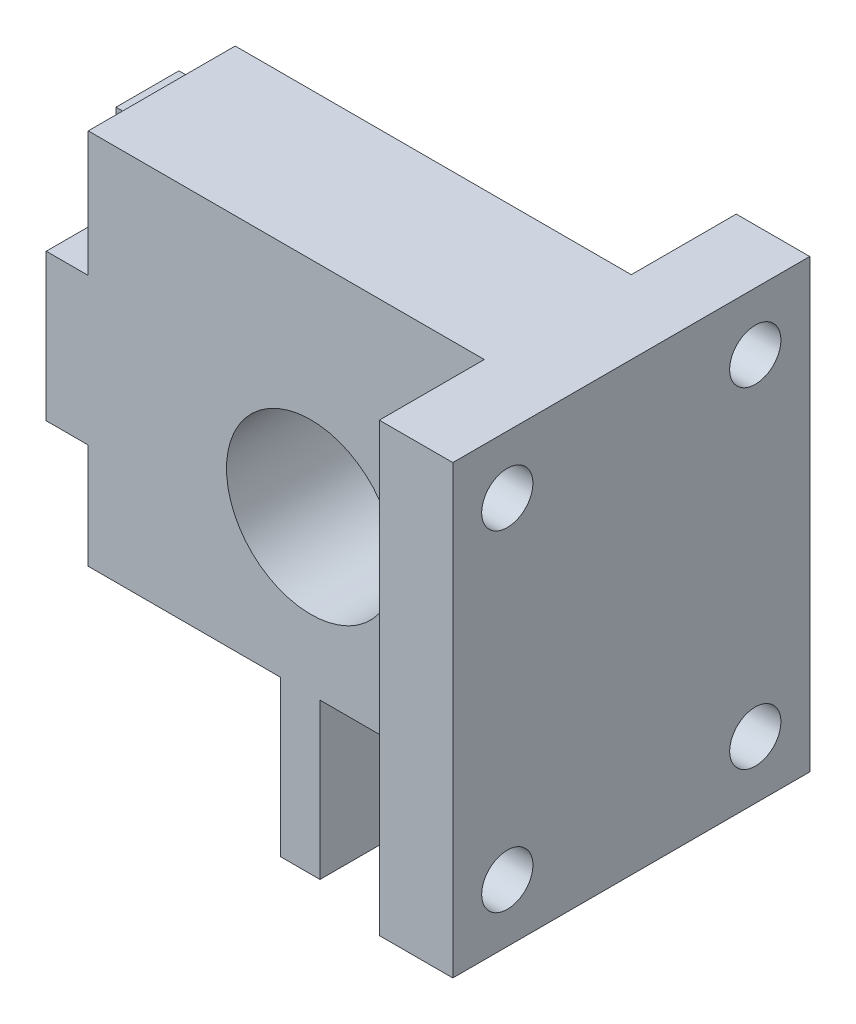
from build123d import *

# Parameters (mm, degrees)
SKETCH1_W                           = 49.611
SKETCH1_H                           = 27.0002
EXTRUDE1_DEPTH                      = 8.89
M12X1_0_TAPPED_HOLE1_D              = 10.2
SKETCH12_R                          = 7.9375
EXTRUDE2_DEPTH                      = 3.81
F_3_8_0_375000_DIAMETER_HOLE1_D     = 9.525
F_3_8_0_375000_DIAMETER_HOLE1_DEPTH = 25.4
F_3_8_0_375000_DIAMETER_HOLE1_TIP   = 2.861598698
SKETCH16_W                          = 4.445
SKETCH16_H                          = 27.0002
EXTRUDE4_DEPTH                      = 6.35
SKETCH19_W                          = 4.445
SKETCH19_H                          = 27.0002
EXTRUDE5_DEPTH                      = 6.35
M3_1_3_100000_DIAMETER_HOLE2_D      = 3.1
SKETCH20_W                          = 41.656
SKETCH20_H                          = 6.03470191
CUT_EXTRUDE1_DEPTH                  = 46.186567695
SKETCH21_W                          = 2.38125
SKETCH21_H                          = 8.89
EXTRUDE6_DEPTH                      = 9.398
CHAMFER2_SIZE                       = 8.89
SKETCH22_W                          = 21.209
SKETCH22_H                          = 22.8092
CUT_EXTRUDE2_DEPTH                  = 48.005625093
SKETCH23_W                          = 8.89
SKETCH23_H                          = 8.88492
EXTRUDE8_DEPTH                      = 2.54
SKETCH26_W                          = 11.7856
SKETCH26_H                          = 8.88492
EXTRUDE9_DEPTH                      = 4.572
SKETCH27_W                          = 5.4356
SKETCH27_H                          = 8.88492
CUT_EXTRUDE4_DEPTH                  = 0.762
M3_5X0_6_TAPPED_HOLE1_D             = 2.9
F_5_40_TAPPED_HOLE1_D               = 2.5781
F_5_40_TAPPED_HOLE1_DEPTH           = 6.985


with BuildPart() as part:
    # Sketch1 → Extrude1 (new body)
    with BuildSketch(Plane.XY):
        with Locations((15.5345, 0)):
            Rectangle(SKETCH1_W, SKETCH1_H)
    extrude(amount=EXTRUDE1_DEPTH)

    # M12x1.0 Tapped Hole1 (through all)
    with Locations(Plane.XY.offset(8.89)):
        with Locations((25.4, 0)):
            Hole(M12X1_0_TAPPED_HOLE1_D / 2)

    # Sketch12 → Extrude2 (add)
    with BuildSketch(Plane(origin=(0, 0, 0), x_dir=(-1, 0, 0), z_dir=(0, 0, -1))):
        with Locations(Location((0, 0, 0), (0, 0, 180))):
            Circle(SKETCH12_R)
    extrude(amount=EXTRUDE2_DEPTH)

    # 3_8 _0.375000_ Diameter Hole1
    with Locations(Plane.XY.offset(8.89)):
        with Locations((0, 0)):
            Hole(F_3_8_0_375000_DIAMETER_HOLE1_D / 2, depth=F_3_8_0_375000_DIAMETER_HOLE1_DEPTH)
            with Locations((0, 0, -(F_3_8_0_375000_DIAMETER_HOLE1_DEPTH + F_3_8_0_375000_DIAMETER_HOLE1_TIP / 2))):  # 118° drill point
                Cone(0, F_3_8_0_375000_DIAMETER_HOLE1_D / 2, F_3_8_0_375000_DIAMETER_HOLE1_TIP, mode=Mode.SUBTRACT)

    # Sketch16 → Extrude4 (add)
    with BuildSketch(Plane(origin=(0, 0, 0), x_dir=(-1, 0, 0), z_dir=(0, 0, -1))):
        with Locations((-38.1175, 0)):
            Rectangle(SKETCH16_W, SKETCH16_H)
    extrude(amount=EXTRUDE4_DEPTH)

    # Sketch19 → Extrude5 (add)
    with BuildSketch(Plane.XY.offset(8.89)):
        with Locations((38.1175, 0)):
            Rectangle(SKETCH19_W, SKETCH19_H)
    extrude(amount=EXTRUDE5_DEPTH)

    # M3.1 _3.100000_ Diameter Hole2 (through all)
    with Locations(Plane.ZY.offset(-35.895)):
        with Locations((-3.055, 10), (-3.055, -10), (11.945, 10), (11.945, -10)):
            Hole(M3_1_3_100000_DIAMETER_HOLE2_D / 2)

    # Sketch20 → Cut-Extrude1 (cut, through all)
    with BuildSketch(Plane(origin=(0, 0, 0), x_dir=(-1, 0, 0), z_dir=(0, 0, -1))):
        with Locations((-11.557, -12.326450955)):
            Rectangle(SKETCH20_W, SKETCH20_H)
    extrude(amount=-CUT_EXTRUDE1_DEPTH, mode=Mode.SUBTRACT)

    # Sketch21 → Extrude6 (add)
    with BuildSketch(Plane.XZ.offset(9.3091)):
        with Locations((24.765, 4.445)):
            Rectangle(SKETCH21_W, SKETCH21_H)
    extrude(amount=EXTRUDE6_DEPTH)

    # Chamfer2
    chamfer2_edges = [part.edges().sort_by_distance(p)[0] for p in [
        (-9.271, 13.5001, 4.445),
    ]]
    chamfer(chamfer2_edges, length=CHAMFER2_SIZE)

    # Sketch22 → Cut-Extrude2 (cut, through all)
    with BuildSketch(Plane.XY.offset(8.89)):
        with Locations((1.3335, 2.0955)):
            Rectangle(SKETCH22_W, SKETCH22_H)
    extrude(amount=-CUT_EXTRUDE2_DEPTH, mode=Mode.SUBTRACT)

    # Sketch23 → Extrude8 (add)
    with BuildSketch(Plane.ZY.offset(-11.938)):
        with Locations((4.445, 1.48336)):
            Rectangle(SKETCH23_W, SKETCH23_H)
    extrude(amount=EXTRUDE8_DEPTH)

    # Sketch26 → Extrude9 (add)
    with BuildSketch(Plane(origin=(0, 0, 0), x_dir=(-1, 0, 0), z_dir=(0, 0, -1))):
        with Locations((-9.8552, 1.48336)):
            Rectangle(SKETCH26_W, SKETCH26_H)
    extrude(amount=EXTRUDE9_DEPTH)

    # Sketch27 → Cut-Extrude4 (cut)
    with BuildSketch(Plane.XY):
        with Locations((6.6802, 1.48336)):
            Rectangle(SKETCH27_W, SKETCH27_H)
    extrude(amount=-CUT_EXTRUDE4_DEPTH, mode=Mode.SUBTRACT)

    # M3.5x0.6 Tapped Hole1 (through all)
    with Locations(Plane(origin=(0, 0, -4.572), x_dir=(-1, 0, 0), z_dir=(0, 0, -1))):
        with Locations((-6.6802, 1.48336)):
            Hole(M3_5X0_6_TAPPED_HOLE1_D / 2)

    # 5-40 Tapped Hole1
    with Locations(Plane.ZY.offset(-11.938)):
        with Locations((4.445, -6.141443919), (4.445, 9.701637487)):
            Hole(F_5_40_TAPPED_HOLE1_D / 2, depth=F_5_40_TAPPED_HOLE1_DEPTH)


solid = part.part
